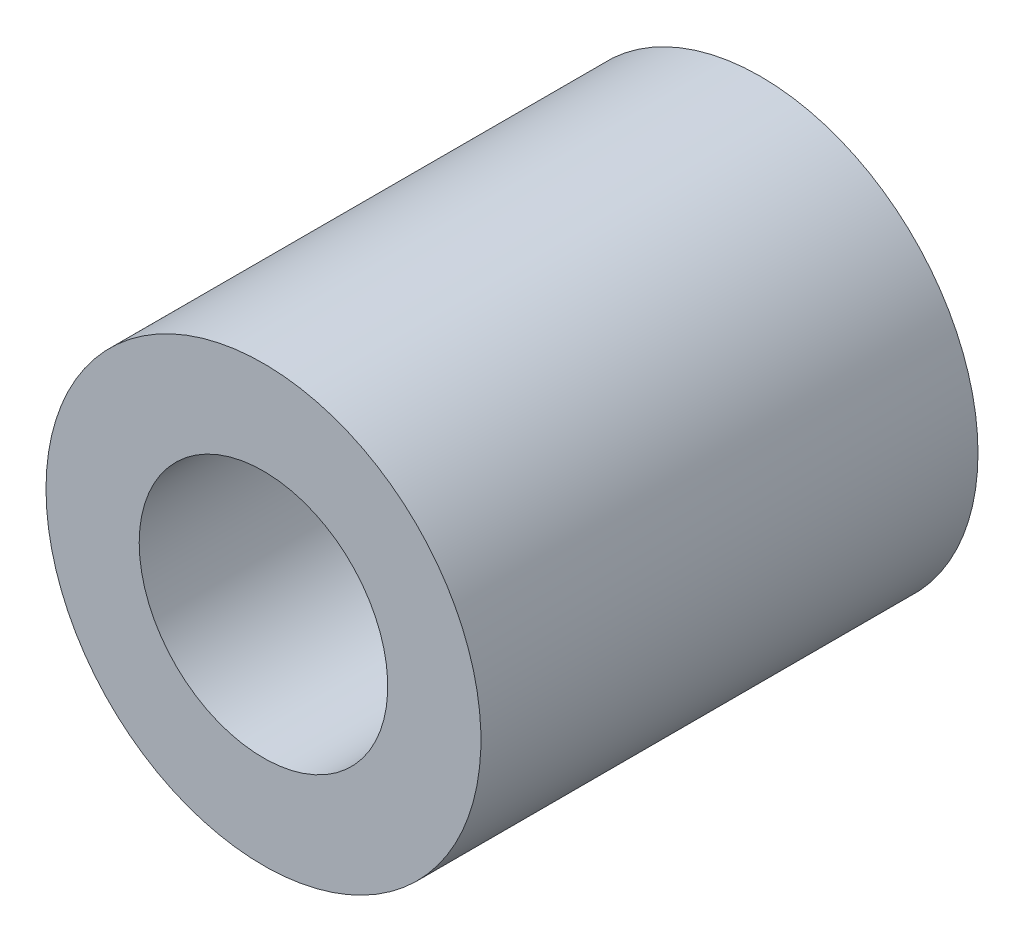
from build123d import *

# Parameters (mm, degrees)
ESQUISSE1_R      = 3.5
ESQUISSE1_R_2    = 2
EXTRUSION1_DEPTH = 8


with BuildPart() as part:
    # Esquisse1 → Extrusion1 (new body)
    with BuildSketch(Plane.XY):
        with Locations(Location((-9.822934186, 33.593302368, 0), (0, 0, 180))):
            Circle(ESQUISSE1_R)
        with Locations(Location((-9.822934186, 33.593302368, 0), (0, 0, 180))):
            Circle(ESQUISSE1_R_2, mode=Mode.SUBTRACT)
    extrude(amount=EXTRUSION1_DEPTH)


solid = part.part
